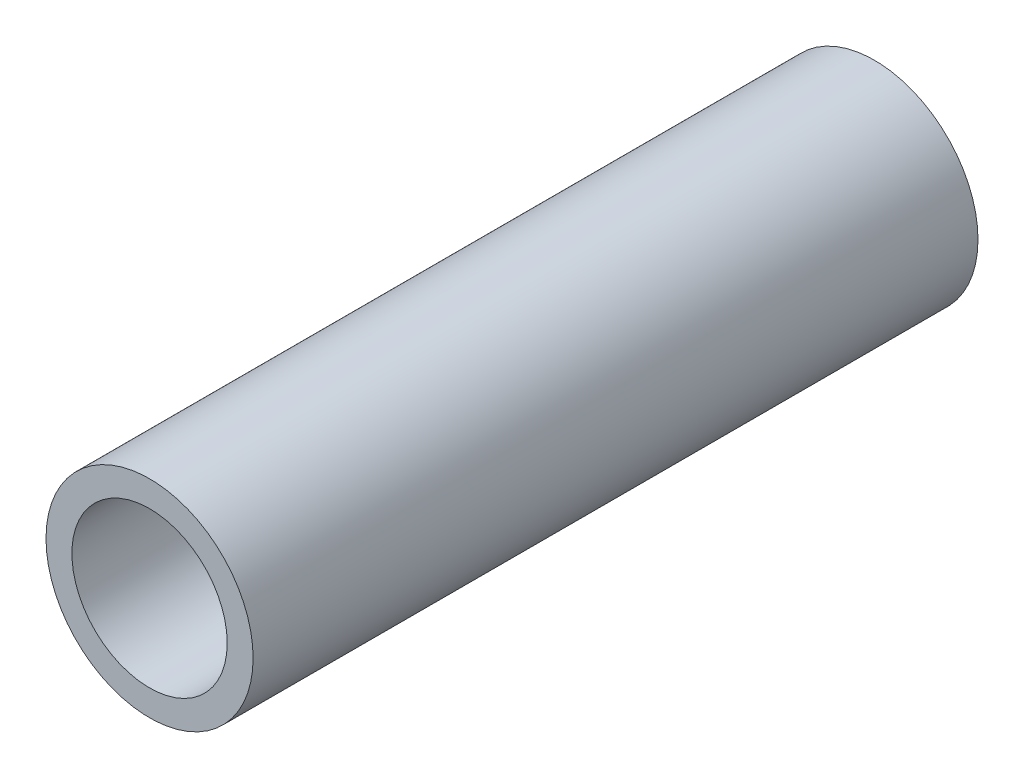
ISO-10303-21;
HEADER;
FILE_DESCRIPTION(('STEP AP214'),'2;1');
FILE_NAME('part.step','',(''),(''),'','','');
FILE_SCHEMA(('AUTOMOTIVE_DESIGN { 1 0 10303 214 1 1 1 1 }'));
ENDSEC;
DATA;
#1=APPLICATION_CONTEXT('core data for automotive mechanical design processes');
#2=APPLICATION_PROTOCOL_DEFINITION('international standard','automotive_design',2000,#1);
#3=PRODUCT_CONTEXT('',#1,'mechanical');
#4=PRODUCT('Part','Part','',(#3));
#5=PRODUCT_RELATED_PRODUCT_CATEGORY('part','',(#4));
#6=PRODUCT_DEFINITION_FORMATION('','',#4);
#7=PRODUCT_DEFINITION_CONTEXT('part definition',#1,'design');
#8=PRODUCT_DEFINITION('design','',#6,#7);
#9=PRODUCT_DEFINITION_SHAPE('','',#8);
#10=(LENGTH_UNIT() NAMED_UNIT(*) SI_UNIT(.MILLI.,.METRE.));
#11=(NAMED_UNIT(*) PLANE_ANGLE_UNIT() SI_UNIT($,.RADIAN.));
#12=(NAMED_UNIT(*) SI_UNIT($,.STERADIAN.) SOLID_ANGLE_UNIT());
#13=UNCERTAINTY_MEASURE_WITH_UNIT(LENGTH_MEASURE(1.E-05),#10,'distance_accuracy_value','');
#14=(GEOMETRIC_REPRESENTATION_CONTEXT(3) GLOBAL_UNCERTAINTY_ASSIGNED_CONTEXT((#13)) GLOBAL_UNIT_ASSIGNED_CONTEXT((#10,
#11,#12)) REPRESENTATION_CONTEXT('',''));
#15=CARTESIAN_POINT('',(0.,0.,0.));
#16=DIRECTION('',(0.,0.,1.));
#17=DIRECTION('',(1.,0.,0.));
#18=AXIS2_PLACEMENT_3D('',#15,#16,#17);
#19=CARTESIAN_POINT('',(-6.35,0.,-31.6389064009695));
#20=DIRECTION('',(0.,0.,1.));
#21=DIRECTION('',(1.,0.,0.));
#22=AXIS2_PLACEMENT_3D('',#19,#20,#21);
#23=PLANE('',#22);
#24=CARTESIAN_POINT('',(0.,0.,-31.6389064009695));
#25=DIRECTION('',(0.,0.,1.));
#26=DIRECTION('',(1.,0.,0.));
#27=AXIS2_PLACEMENT_3D('',#24,#25,#26);
#28=CIRCLE('',#27,6.35);
#29=CARTESIAN_POINT('',(6.35,0.,-31.6389064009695));
#30=VERTEX_POINT('',#29);
#31=EDGE_CURVE('E43',#30,#30,#28,.T.);
#32=ORIENTED_EDGE('',*,*,#31,.F.);
#33=EDGE_LOOP('',(#32));
#34=FACE_BOUND('',#33,.T.);
#35=CARTESIAN_POINT('',(0.,0.,-31.6389064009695));
#36=DIRECTION('',(0.,0.,1.));
#37=DIRECTION('',(1.,0.,0.));
#38=AXIS2_PLACEMENT_3D('',#35,#36,#37);
#39=CIRCLE('',#38,4.7625);
#40=CARTESIAN_POINT('',(4.7625,0.,-31.6389064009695));
#41=VERTEX_POINT('',#40);
#42=EDGE_CURVE('E10',#41,#41,#39,.T.);
#43=ORIENTED_EDGE('',*,*,#42,.T.);
#44=EDGE_LOOP('',(#43));
#45=FACE_BOUND('',#44,.T.);
#46=ADVANCED_FACE('F29',(#34,#45),#23,.F.);
#47=CARTESIAN_POINT('',(0.,0.,12.8110935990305));
#48=DIRECTION('',(0.,0.,1.));
#49=DIRECTION('',(1.,0.,0.));
#50=AXIS2_PLACEMENT_3D('',#47,#48,#49);
#51=CYLINDRICAL_SURFACE('',#50,4.7625);
#52=ORIENTED_EDGE('',*,*,#42,.F.);
#53=EDGE_LOOP('',(#52));
#54=FACE_BOUND('',#53,.T.);
#55=CARTESIAN_POINT('',(0.,0.,12.8110935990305));
#56=DIRECTION('',(0.,0.,1.));
#57=DIRECTION('',(1.,0.,0.));
#58=AXIS2_PLACEMENT_3D('',#55,#56,#57);
#59=CIRCLE('',#58,4.76249999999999);
#60=CARTESIAN_POINT('',(4.76249999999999,0.,12.8110935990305));
#61=VERTEX_POINT('',#60);
#62=EDGE_CURVE('E35',#61,#61,#59,.T.);
#63=ORIENTED_EDGE('',*,*,#62,.T.);
#64=EDGE_LOOP('',(#63));
#65=FACE_BOUND('',#64,.T.);
#66=ADVANCED_FACE('F52',(#54,#65),#51,.F.);
#67=CARTESIAN_POINT('',(-6.34999999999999,0.,12.8110935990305));
#68=DIRECTION('',(0.,0.,-1.));
#69=DIRECTION('',(-1.,0.,0.));
#70=AXIS2_PLACEMENT_3D('',#67,#68,#69);
#71=PLANE('',#70);
#72=ORIENTED_EDGE('',*,*,#62,.F.);
#73=EDGE_LOOP('',(#72));
#74=FACE_BOUND('',#73,.T.);
#75=CARTESIAN_POINT('',(0.,0.,12.8110935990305));
#76=DIRECTION('',(0.,0.,1.));
#77=DIRECTION('',(1.,0.,0.));
#78=AXIS2_PLACEMENT_3D('',#75,#76,#77);
#79=CIRCLE('',#78,6.34999999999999);
#80=CARTESIAN_POINT('',(6.34999999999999,0.,12.8110935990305));
#81=VERTEX_POINT('',#80);
#82=EDGE_CURVE('E39',#81,#81,#79,.T.);
#83=ORIENTED_EDGE('',*,*,#82,.T.);
#84=EDGE_LOOP('',(#83));
#85=FACE_BOUND('',#84,.T.);
#86=ADVANCED_FACE('F56',(#74,#85),#71,.F.);
#87=CARTESIAN_POINT('',(0.,0.,12.8110935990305));
#88=DIRECTION('',(0.,0.,1.));
#89=DIRECTION('',(1.,0.,0.));
#90=AXIS2_PLACEMENT_3D('',#87,#88,#89);
#91=CYLINDRICAL_SURFACE('',#90,6.35);
#92=ORIENTED_EDGE('',*,*,#82,.F.);
#93=EDGE_LOOP('',(#92));
#94=FACE_BOUND('',#93,.T.);
#95=ORIENTED_EDGE('',*,*,#31,.T.);
#96=EDGE_LOOP('',(#95));
#97=FACE_BOUND('',#96,.T.);
#98=ADVANCED_FACE('F49',(#94,#97),#91,.T.);
#99=CLOSED_SHELL('',(#46,#66,#86,#98));
#100=MANIFOLD_SOLID_BREP('B2',#99);
#101=ADVANCED_BREP_SHAPE_REPRESENTATION('',(#18,#100),#14);
#102=SHAPE_DEFINITION_REPRESENTATION(#9,#101);
ENDSEC;
END-ISO-10303-21;
